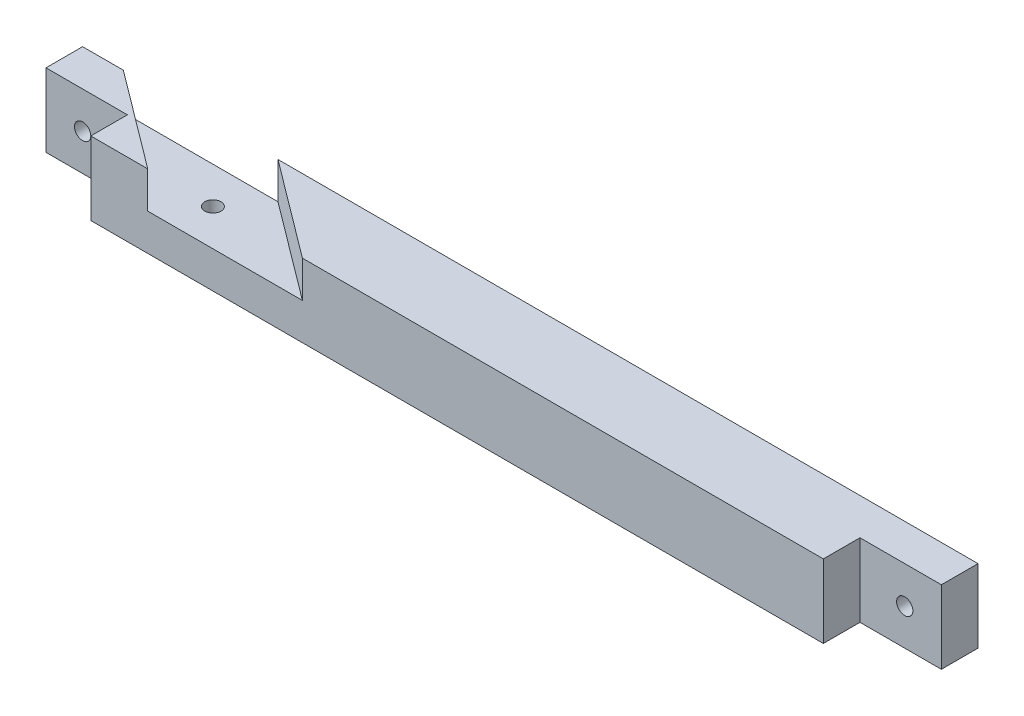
ISO-10303-21;
HEADER;
FILE_DESCRIPTION(('STEP AP214'),'2;1');
FILE_NAME('part.step','',(''),(''),'','','');
FILE_SCHEMA(('AUTOMOTIVE_DESIGN { 1 0 10303 214 1 1 1 1 }'));
ENDSEC;
DATA;
#1=APPLICATION_CONTEXT('core data for automotive mechanical design processes');
#2=APPLICATION_PROTOCOL_DEFINITION('international standard','automotive_design',2000,#1);
#3=PRODUCT_CONTEXT('',#1,'mechanical');
#4=PRODUCT('Part','Part','',(#3));
#5=PRODUCT_RELATED_PRODUCT_CATEGORY('part','',(#4));
#6=PRODUCT_DEFINITION_FORMATION('','',#4);
#7=PRODUCT_DEFINITION_CONTEXT('part definition',#1,'design');
#8=PRODUCT_DEFINITION('design','',#6,#7);
#9=PRODUCT_DEFINITION_SHAPE('','',#8);
#10=(LENGTH_UNIT() NAMED_UNIT(*) SI_UNIT(.MILLI.,.METRE.));
#11=(NAMED_UNIT(*) PLANE_ANGLE_UNIT() SI_UNIT($,.RADIAN.));
#12=(NAMED_UNIT(*) SI_UNIT($,.STERADIAN.) SOLID_ANGLE_UNIT());
#13=UNCERTAINTY_MEASURE_WITH_UNIT(LENGTH_MEASURE(1.E-05),#10,'distance_accuracy_value','');
#14=(GEOMETRIC_REPRESENTATION_CONTEXT(3) GLOBAL_UNCERTAINTY_ASSIGNED_CONTEXT((#13)) GLOBAL_UNIT_ASSIGNED_CONTEXT((#10,
#11,#12)) REPRESENTATION_CONTEXT('',''));
#15=CARTESIAN_POINT('',(0.,0.,0.));
#16=DIRECTION('',(0.,0.,1.));
#17=DIRECTION('',(1.,0.,0.));
#18=AXIS2_PLACEMENT_3D('',#15,#16,#17);
#19=CARTESIAN_POINT('',(-67.2716845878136,-100.617562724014,9.));
#20=DIRECTION('',(0.,-1.,0.));
#21=DIRECTION('',(0.,0.,-1.));
#22=AXIS2_PLACEMENT_3D('',#19,#20,#21);
#23=PLANE('',#22);
#24=DIRECTION('',(-1.,0.,0.));
#25=VECTOR('',#24,1.);
#26=CARTESIAN_POINT('',(-67.2716845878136,-100.617562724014,9.));
#27=LINE('',#26,#25);
#28=CARTESIAN_POINT('',(-50.2716845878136,-100.617562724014,9.));
#29=VERTEX_POINT('',#28);
#30=CARTESIAN_POINT('',(-57.2716845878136,-100.617562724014,9.));
#31=VERTEX_POINT('',#30);
#32=EDGE_CURVE('E210',#29,#31,#27,.T.);
#33=ORIENTED_EDGE('',*,*,#32,.F.);
#34=DIRECTION('',(0.8,0.,0.6));
#35=VECTOR('',#34,1.);
#36=CARTESIAN_POINT('',(-50.2716845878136,-100.617562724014,9.));
#37=LINE('',#36,#35);
#38=CARTESIAN_POINT('',(-62.2716845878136,-100.617562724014,0.));
#39=VERTEX_POINT('',#38);
#40=EDGE_CURVE('E138',#39,#29,#37,.T.);
#41=ORIENTED_EDGE('',*,*,#40,.F.);
#42=DIRECTION('',(-1.,0.,0.));
#43=VECTOR('',#42,1.);
#44=CARTESIAN_POINT('',(-67.2716845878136,-100.617562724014,0.));
#45=LINE('',#44,#43);
#46=CARTESIAN_POINT('',(-67.2716845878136,-100.617562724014,0.));
#47=VERTEX_POINT('',#46);
#48=EDGE_CURVE('E223',#39,#47,#45,.T.);
#49=ORIENTED_EDGE('',*,*,#48,.T.);
#50=DIRECTION('',(0.,0.,-1.));
#51=VECTOR('',#50,1.);
#52=CARTESIAN_POINT('',(-67.2716845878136,-100.617562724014,9.));
#53=LINE('',#52,#51);
#54=CARTESIAN_POINT('',(-67.2716845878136,-100.617562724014,4.5));
#55=VERTEX_POINT('',#54);
#56=EDGE_CURVE('E214',#55,#47,#53,.T.);
#57=ORIENTED_EDGE('',*,*,#56,.F.);
#58=DIRECTION('',(-1.,0.,0.));
#59=VECTOR('',#58,1.);
#60=CARTESIAN_POINT('',(-67.2716845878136,-100.617562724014,4.5));
#61=LINE('',#60,#59);
#62=CARTESIAN_POINT('',(-57.2716845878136,-100.617562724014,4.5));
#63=VERTEX_POINT('',#62);
#64=EDGE_CURVE('E197',#63,#55,#61,.T.);
#65=ORIENTED_EDGE('',*,*,#64,.F.);
#66=DIRECTION('',(0.,0.,1.));
#67=VECTOR('',#66,1.);
#68=CARTESIAN_POINT('',(-57.2716845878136,-100.617562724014,4.5));
#69=LINE('',#68,#67);
#70=EDGE_CURVE('E202',#63,#31,#69,.T.);
#71=ORIENTED_EDGE('',*,*,#70,.T.);
#72=EDGE_LOOP('',(#33,#41,#49,#57,#65,#71));
#73=FACE_BOUND('',#72,.T.);
#74=ADVANCED_FACE('F30',(#73),#23,.F.);
#75=CARTESIAN_POINT('',(42.7283154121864,-109.617562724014,9.));
#76=DIRECTION('',(-1.,0.,0.));
#77=DIRECTION('',(0.,0.,1.));
#78=AXIS2_PLACEMENT_3D('',#75,#76,#77);
#79=PLANE('',#78);
#80=DIRECTION('',(0.,1.,0.));
#81=VECTOR('',#80,1.);
#82=CARTESIAN_POINT('',(42.7283154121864,-109.617562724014,4.5));
#83=LINE('',#82,#81);
#84=CARTESIAN_POINT('',(42.7283154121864,-109.617562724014,4.5));
#85=VERTEX_POINT('',#84);
#86=CARTESIAN_POINT('',(42.7283154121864,-100.617562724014,4.5));
#87=VERTEX_POINT('',#86);
#88=EDGE_CURVE('E173',#85,#87,#83,.T.);
#89=ORIENTED_EDGE('',*,*,#88,.F.);
#90=DIRECTION('',(0.,0.,-1.));
#91=VECTOR('',#90,1.);
#92=CARTESIAN_POINT('',(42.7283154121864,-109.617562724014,9.));
#93=LINE('',#92,#91);
#94=CARTESIAN_POINT('',(42.7283154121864,-109.617562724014,0.));
#95=VERTEX_POINT('',#94);
#96=EDGE_CURVE('E230',#85,#95,#93,.T.);
#97=ORIENTED_EDGE('',*,*,#96,.T.);
#98=DIRECTION('',(0.,1.,0.));
#99=VECTOR('',#98,1.);
#100=CARTESIAN_POINT('',(42.7283154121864,-109.617562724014,0.));
#101=LINE('',#100,#99);
#102=CARTESIAN_POINT('',(42.7283154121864,-100.617562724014,0.));
#103=VERTEX_POINT('',#102);
#104=EDGE_CURVE('E220',#95,#103,#101,.T.);
#105=ORIENTED_EDGE('',*,*,#104,.T.);
#106=DIRECTION('',(0.,0.,-1.));
#107=VECTOR('',#106,1.);
#108=CARTESIAN_POINT('',(42.7283154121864,-100.617562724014,9.));
#109=LINE('',#108,#107);
#110=EDGE_CURVE('E228',#87,#103,#109,.T.);
#111=ORIENTED_EDGE('',*,*,#110,.F.);
#112=EDGE_LOOP('',(#89,#97,#105,#111));
#113=FACE_BOUND('',#112,.T.);
#114=ADVANCED_FACE('F269',(#113),#79,.F.);
#115=CARTESIAN_POINT('',(-67.2716845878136,-109.617562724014,9.));
#116=DIRECTION('',(1.,0.,0.));
#117=DIRECTION('',(0.,0.,-1.));
#118=AXIS2_PLACEMENT_3D('',#115,#116,#117);
#119=PLANE('',#118);
#120=DIRECTION('',(0.,0.,-1.));
#121=VECTOR('',#120,1.);
#122=CARTESIAN_POINT('',(-67.2716845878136,-109.617562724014,9.));
#123=LINE('',#122,#121);
#124=CARTESIAN_POINT('',(-67.2716845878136,-109.617562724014,4.5));
#125=VERTEX_POINT('',#124);
#126=CARTESIAN_POINT('',(-67.2716845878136,-109.617562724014,0.));
#127=VERTEX_POINT('',#126);
#128=EDGE_CURVE('E232',#125,#127,#123,.T.);
#129=ORIENTED_EDGE('',*,*,#128,.F.);
#130=DIRECTION('',(0.,-1.,0.));
#131=VECTOR('',#130,1.);
#132=CARTESIAN_POINT('',(-67.2716845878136,-109.617562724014,4.5));
#133=LINE('',#132,#131);
#134=EDGE_CURVE('E189',#55,#125,#133,.T.);
#135=ORIENTED_EDGE('',*,*,#134,.F.);
#136=ORIENTED_EDGE('',*,*,#56,.T.);
#137=DIRECTION('',(0.,-1.,0.));
#138=VECTOR('',#137,1.);
#139=CARTESIAN_POINT('',(-67.2716845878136,-109.617562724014,0.));
#140=LINE('',#139,#138);
#141=EDGE_CURVE('E205',#47,#127,#140,.T.);
#142=ORIENTED_EDGE('',*,*,#141,.T.);
#143=EDGE_LOOP('',(#129,#135,#136,#142));
#144=FACE_BOUND('',#143,.T.);
#145=ADVANCED_FACE('F32',(#144),#119,.F.);
#146=CARTESIAN_POINT('',(-67.2716845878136,-109.617562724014,9.));
#147=DIRECTION('',(0.,1.,0.));
#148=DIRECTION('',(0.,0.,1.));
#149=AXIS2_PLACEMENT_3D('',#146,#147,#148);
#150=PLANE('',#149);
#151=CARTESIAN_POINT('',(-46.7716845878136,-109.617562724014,4.5));
#152=DIRECTION('',(0.,1.,0.));
#153=DIRECTION('',(0.,0.,1.));
#154=AXIS2_PLACEMENT_3D('',#151,#152,#153);
#155=CIRCLE('',#154,0.999999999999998);
#156=CARTESIAN_POINT('',(-46.7716845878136,-109.617562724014,5.5));
#157=VERTEX_POINT('',#156);
#158=EDGE_CURVE('E152',#157,#157,#155,.T.);
#159=ORIENTED_EDGE('',*,*,#158,.T.);
#160=EDGE_LOOP('',(#159));
#161=FACE_BOUND('',#160,.T.);
#162=DIRECTION('',(1.,0.,0.));
#163=VECTOR('',#162,1.);
#164=CARTESIAN_POINT('',(42.7283154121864,-109.617562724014,4.5));
#165=LINE('',#164,#163);
#166=CARTESIAN_POINT('',(32.7283154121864,-109.617562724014,4.5));
#167=VERTEX_POINT('',#166);
#168=EDGE_CURVE('E181',#167,#85,#165,.T.);
#169=ORIENTED_EDGE('',*,*,#168,.F.);
#170=DIRECTION('',(0.,0.,1.));
#171=VECTOR('',#170,1.);
#172=CARTESIAN_POINT('',(32.7283154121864,-109.617562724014,4.5));
#173=LINE('',#172,#171);
#174=CARTESIAN_POINT('',(32.7283154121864,-109.617562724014,9.));
#175=VERTEX_POINT('',#174);
#176=EDGE_CURVE('E184',#167,#175,#173,.T.);
#177=ORIENTED_EDGE('',*,*,#176,.T.);
#178=DIRECTION('',(1.,0.,0.));
#179=VECTOR('',#178,1.);
#180=CARTESIAN_POINT('',(-67.2716845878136,-109.617562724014,9.));
#181=LINE('',#180,#179);
#182=CARTESIAN_POINT('',(-57.2716845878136,-109.617562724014,9.));
#183=VERTEX_POINT('',#182);
#184=EDGE_CURVE('E207',#183,#175,#181,.T.);
#185=ORIENTED_EDGE('',*,*,#184,.F.);
#186=DIRECTION('',(0.,0.,1.));
#187=VECTOR('',#186,1.);
#188=CARTESIAN_POINT('',(-57.2716845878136,-109.617562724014,4.5));
#189=LINE('',#188,#187);
#190=CARTESIAN_POINT('',(-57.2716845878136,-109.617562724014,4.5));
#191=VERTEX_POINT('',#190);
#192=EDGE_CURVE('E199',#191,#183,#189,.T.);
#193=ORIENTED_EDGE('',*,*,#192,.F.);
#194=DIRECTION('',(1.,0.,0.));
#195=VECTOR('',#194,1.);
#196=CARTESIAN_POINT('',(-67.2716845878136,-109.617562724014,4.5));
#197=LINE('',#196,#195);
#198=EDGE_CURVE('E191',#125,#191,#197,.T.);
#199=ORIENTED_EDGE('',*,*,#198,.F.);
#200=ORIENTED_EDGE('',*,*,#128,.T.);
#201=DIRECTION('',(1.,0.,0.));
#202=VECTOR('',#201,1.);
#203=CARTESIAN_POINT('',(-67.2716845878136,-109.617562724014,0.));
#204=LINE('',#203,#202);
#205=EDGE_CURVE('E217',#127,#95,#204,.T.);
#206=ORIENTED_EDGE('',*,*,#205,.T.);
#207=ORIENTED_EDGE('',*,*,#96,.F.);
#208=EDGE_LOOP('',(#169,#177,#185,#193,#199,#200,#206,#207));
#209=FACE_BOUND('',#208,.T.);
#210=ADVANCED_FACE('F254',(#161,#209),#150,.F.);
#211=CARTESIAN_POINT('',(-43.2716845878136,-100.617562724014,0.));
#212=VERTEX_POINT('',#211);
#213=EDGE_CURVE('E211',#103,#212,#45,.T.);
#214=ORIENTED_EDGE('',*,*,#213,.T.);
#215=DIRECTION('',(-0.8,0.,-0.6));
#216=VECTOR('',#215,1.);
#217=CARTESIAN_POINT('',(-43.2716845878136,-100.617562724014,0.));
#218=LINE('',#217,#216);
#219=CARTESIAN_POINT('',(-31.2716845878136,-100.617562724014,9.));
#220=VERTEX_POINT('',#219);
#221=EDGE_CURVE('E132',#220,#212,#218,.T.);
#222=ORIENTED_EDGE('',*,*,#221,.F.);
#223=CARTESIAN_POINT('',(32.7283154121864,-100.617562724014,9.));
#224=VERTEX_POINT('',#223);
#225=EDGE_CURVE('E212',#224,#220,#27,.T.);
#226=ORIENTED_EDGE('',*,*,#225,.F.);
#227=DIRECTION('',(0.,0.,1.));
#228=VECTOR('',#227,1.);
#229=CARTESIAN_POINT('',(32.7283154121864,-100.617562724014,4.5));
#230=LINE('',#229,#228);
#231=CARTESIAN_POINT('',(32.7283154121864,-100.617562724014,4.5));
#232=VERTEX_POINT('',#231);
#233=EDGE_CURVE('E53',#232,#224,#230,.T.);
#234=ORIENTED_EDGE('',*,*,#233,.F.);
#235=DIRECTION('',(-1.,0.,0.));
#236=VECTOR('',#235,1.);
#237=CARTESIAN_POINT('',(42.7283154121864,-100.617562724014,4.5));
#238=LINE('',#237,#236);
#239=EDGE_CURVE('E175',#87,#232,#238,.T.);
#240=ORIENTED_EDGE('',*,*,#239,.F.);
#241=ORIENTED_EDGE('',*,*,#110,.T.);
#242=EDGE_LOOP('',(#214,#222,#226,#234,#240,#241));
#243=FACE_BOUND('',#242,.T.);
#244=ADVANCED_FACE('F259',(#243),#23,.F.);
#245=CARTESIAN_POINT('',(-67.2716845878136,-100.617562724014,9.));
#246=DIRECTION('',(0.,0.,-1.));
#247=DIRECTION('',(-1.,0.,0.));
#248=AXIS2_PLACEMENT_3D('',#245,#246,#247);
#249=PLANE('',#248);
#250=DIRECTION('',(1.,0.,0.));
#251=VECTOR('',#250,1.);
#252=CARTESIAN_POINT('',(-31.2716845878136,-105.117562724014,9.));
#253=LINE('',#252,#251);
#254=CARTESIAN_POINT('',(-50.2716845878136,-105.117562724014,9.));
#255=VERTEX_POINT('',#254);
#256=CARTESIAN_POINT('',(-31.2716845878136,-105.117562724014,9.));
#257=VERTEX_POINT('',#256);
#258=EDGE_CURVE('E129',#255,#257,#253,.T.);
#259=ORIENTED_EDGE('',*,*,#258,.F.);
#260=DIRECTION('',(0.,1.,0.));
#261=VECTOR('',#260,1.);
#262=CARTESIAN_POINT('',(-50.2716845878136,-105.117562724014,9.));
#263=LINE('',#262,#261);
#264=EDGE_CURVE('E135',#255,#29,#263,.T.);
#265=ORIENTED_EDGE('',*,*,#264,.T.);
#266=ORIENTED_EDGE('',*,*,#32,.T.);
#267=DIRECTION('',(0.,1.,0.));
#268=VECTOR('',#267,1.);
#269=CARTESIAN_POINT('',(-57.2716845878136,-109.617562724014,9.));
#270=LINE('',#269,#268);
#271=EDGE_CURVE('E187',#183,#31,#270,.T.);
#272=ORIENTED_EDGE('',*,*,#271,.F.);
#273=ORIENTED_EDGE('',*,*,#184,.T.);
#274=DIRECTION('',(0.,-1.,0.));
#275=VECTOR('',#274,1.);
#276=CARTESIAN_POINT('',(32.7283154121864,-109.617562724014,9.));
#277=LINE('',#276,#275);
#278=EDGE_CURVE('E170',#224,#175,#277,.T.);
#279=ORIENTED_EDGE('',*,*,#278,.F.);
#280=ORIENTED_EDGE('',*,*,#225,.T.);
#281=DIRECTION('',(0.,1.,0.));
#282=VECTOR('',#281,1.);
#283=CARTESIAN_POINT('',(-31.2716845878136,-105.117562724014,9.));
#284=LINE('',#283,#282);
#285=EDGE_CURVE('E141',#257,#220,#284,.T.);
#286=ORIENTED_EDGE('',*,*,#285,.F.);
#287=EDGE_LOOP('',(#259,#265,#266,#272,#273,#279,#280,#286));
#288=FACE_BOUND('',#287,.T.);
#289=ADVANCED_FACE('F143',(#288),#249,.F.);
#290=CARTESIAN_POINT('',(-67.2716845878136,-100.617562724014,0.));
#291=DIRECTION('',(0.,0.,-1.));
#292=DIRECTION('',(-1.,0.,0.));
#293=AXIS2_PLACEMENT_3D('',#290,#291,#292);
#294=PLANE('',#293);
#295=DIRECTION('',(0.,1.,0.));
#296=VECTOR('',#295,1.);
#297=CARTESIAN_POINT('',(-62.2716845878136,-105.117562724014,0.));
#298=LINE('',#297,#296);
#299=CARTESIAN_POINT('',(-62.2716845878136,-104.25153732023,0.));
#300=VERTEX_POINT('',#299);
#301=EDGE_CURVE('E154',#300,#39,#298,.T.);
#302=ORIENTED_EDGE('',*,*,#301,.F.);
#303=CARTESIAN_POINT('',(-62.7716845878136,-105.117562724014,0.));
#304=DIRECTION('',(0.,0.,1.));
#305=DIRECTION('',(1.,0.,0.));
#306=AXIS2_PLACEMENT_3D('',#303,#304,#305);
#307=CIRCLE('',#306,0.999999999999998);
#308=CARTESIAN_POINT('',(-61.7716845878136,-105.117562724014,0.));
#309=VERTEX_POINT('',#308);
#310=EDGE_CURVE('E161',#300,#309,#307,.T.);
#311=ORIENTED_EDGE('',*,*,#310,.T.);
#312=DIRECTION('',(-1.,0.,0.));
#313=VECTOR('',#312,1.);
#314=CARTESIAN_POINT('',(-62.2716845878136,-105.117562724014,0.));
#315=LINE('',#314,#313);
#316=CARTESIAN_POINT('',(-43.2716845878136,-105.117562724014,0.));
#317=VERTEX_POINT('',#316);
#318=EDGE_CURVE('E45',#317,#309,#315,.T.);
#319=ORIENTED_EDGE('',*,*,#318,.F.);
#320=DIRECTION('',(0.,1.,0.));
#321=VECTOR('',#320,1.);
#322=CARTESIAN_POINT('',(-43.2716845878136,-105.117562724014,0.));
#323=LINE('',#322,#321);
#324=EDGE_CURVE('E157',#317,#212,#323,.T.);
#325=ORIENTED_EDGE('',*,*,#324,.T.);
#326=ORIENTED_EDGE('',*,*,#213,.F.);
#327=ORIENTED_EDGE('',*,*,#104,.F.);
#328=ORIENTED_EDGE('',*,*,#205,.F.);
#329=ORIENTED_EDGE('',*,*,#141,.F.);
#330=ORIENTED_EDGE('',*,*,#48,.F.);
#331=EDGE_LOOP('',(#302,#311,#319,#325,#326,#327,#328,#329,#330));
#332=FACE_BOUND('',#331,.T.);
#333=CARTESIAN_POINT('',(38.2284017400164,-105.145436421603,0.));
#334=DIRECTION('',(0.,0.,1.));
#335=DIRECTION('',(1.,0.,0.));
#336=AXIS2_PLACEMENT_3D('',#333,#334,#335);
#337=CIRCLE('',#336,0.999999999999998);
#338=CARTESIAN_POINT('',(39.2284017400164,-105.145436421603,0.));
#339=VERTEX_POINT('',#338);
#340=EDGE_CURVE('E167',#339,#339,#337,.T.);
#341=ORIENTED_EDGE('',*,*,#340,.T.);
#342=EDGE_LOOP('',(#341));
#343=FACE_BOUND('',#342,.T.);
#344=ADVANCED_FACE('F239',(#332,#343),#294,.T.);
#345=CARTESIAN_POINT('',(-57.2716845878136,-109.617562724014,4.5));
#346=DIRECTION('',(1.,0.,0.));
#347=DIRECTION('',(0.,1.,0.));
#348=AXIS2_PLACEMENT_3D('',#345,#346,#347);
#349=PLANE('',#348);
#350=ORIENTED_EDGE('',*,*,#271,.T.);
#351=ORIENTED_EDGE('',*,*,#70,.F.);
#352=DIRECTION('',(0.,1.,0.));
#353=VECTOR('',#352,1.);
#354=CARTESIAN_POINT('',(-57.2716845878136,-109.617562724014,4.5));
#355=LINE('',#354,#353);
#356=EDGE_CURVE('E194',#191,#63,#355,.T.);
#357=ORIENTED_EDGE('',*,*,#356,.F.);
#358=ORIENTED_EDGE('',*,*,#192,.T.);
#359=EDGE_LOOP('',(#350,#351,#357,#358));
#360=FACE_BOUND('',#359,.T.);
#361=ADVANCED_FACE('F249',(#360),#349,.F.);
#362=CARTESIAN_POINT('',(-67.2716845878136,-100.617562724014,4.5));
#363=DIRECTION('',(0.,0.,-1.));
#364=DIRECTION('',(-1.,0.,0.));
#365=AXIS2_PLACEMENT_3D('',#362,#363,#364);
#366=PLANE('',#365);
#367=CARTESIAN_POINT('',(-62.7716845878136,-105.117562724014,4.5));
#368=DIRECTION('',(0.,0.,1.));
#369=DIRECTION('',(1.,0.,0.));
#370=AXIS2_PLACEMENT_3D('',#367,#368,#369);
#371=CIRCLE('',#370,0.999999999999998);
#372=CARTESIAN_POINT('',(-61.7716845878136,-105.117562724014,4.5));
#373=VERTEX_POINT('',#372);
#374=EDGE_CURVE('E156',#373,#373,#371,.T.);
#375=ORIENTED_EDGE('',*,*,#374,.F.);
#376=EDGE_LOOP('',(#375));
#377=FACE_BOUND('',#376,.T.);
#378=ORIENTED_EDGE('',*,*,#134,.T.);
#379=ORIENTED_EDGE('',*,*,#198,.T.);
#380=ORIENTED_EDGE('',*,*,#356,.T.);
#381=ORIENTED_EDGE('',*,*,#64,.T.);
#382=EDGE_LOOP('',(#378,#379,#380,#381));
#383=FACE_BOUND('',#382,.T.);
#384=ADVANCED_FACE('F274',(#377,#383),#366,.F.);
#385=CARTESIAN_POINT('',(32.7283154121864,-109.617562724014,4.5));
#386=DIRECTION('',(-1.,0.,0.));
#387=DIRECTION('',(0.,0.,1.));
#388=AXIS2_PLACEMENT_3D('',#385,#386,#387);
#389=PLANE('',#388);
#390=ORIENTED_EDGE('',*,*,#278,.T.);
#391=ORIENTED_EDGE('',*,*,#176,.F.);
#392=DIRECTION('',(0.,-1.,0.));
#393=VECTOR('',#392,1.);
#394=CARTESIAN_POINT('',(32.7283154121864,-109.617562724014,4.5));
#395=LINE('',#394,#393);
#396=EDGE_CURVE('E178',#232,#167,#395,.T.);
#397=ORIENTED_EDGE('',*,*,#396,.F.);
#398=ORIENTED_EDGE('',*,*,#233,.T.);
#399=EDGE_LOOP('',(#390,#391,#397,#398));
#400=FACE_BOUND('',#399,.T.);
#401=ADVANCED_FACE('F276',(#400),#389,.F.);
#402=CARTESIAN_POINT('',(42.7283154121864,-100.617562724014,4.5));
#403=DIRECTION('',(0.,0.,1.));
#404=DIRECTION('',(1.,0.,0.));
#405=AXIS2_PLACEMENT_3D('',#402,#403,#404);
#406=PLANE('',#405);
#407=CARTESIAN_POINT('',(38.2284017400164,-105.145436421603,4.5));
#408=DIRECTION('',(0.,0.,1.));
#409=DIRECTION('',(1.,0.,0.));
#410=AXIS2_PLACEMENT_3D('',#407,#408,#409);
#411=CIRCLE('',#410,0.999999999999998);
#412=CARTESIAN_POINT('',(39.2284017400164,-105.145436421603,4.5));
#413=VERTEX_POINT('',#412);
#414=EDGE_CURVE('E164',#413,#413,#411,.T.);
#415=ORIENTED_EDGE('',*,*,#414,.F.);
#416=EDGE_LOOP('',(#415));
#417=FACE_BOUND('',#416,.T.);
#418=ORIENTED_EDGE('',*,*,#88,.T.);
#419=ORIENTED_EDGE('',*,*,#239,.T.);
#420=ORIENTED_EDGE('',*,*,#396,.T.);
#421=ORIENTED_EDGE('',*,*,#168,.T.);
#422=EDGE_LOOP('',(#418,#419,#420,#421));
#423=FACE_BOUND('',#422,.T.);
#424=ADVANCED_FACE('F283',(#417,#423),#406,.T.);
#425=CARTESIAN_POINT('',(38.2284017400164,-105.145436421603,0.));
#426=DIRECTION('',(0.,0.,1.));
#427=DIRECTION('',(1.,0.,0.));
#428=AXIS2_PLACEMENT_3D('',#425,#426,#427);
#429=CYLINDRICAL_SURFACE('',#428,0.999999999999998);
#430=ORIENTED_EDGE('',*,*,#340,.F.);
#431=EDGE_LOOP('',(#430));
#432=FACE_BOUND('',#431,.T.);
#433=ORIENTED_EDGE('',*,*,#414,.T.);
#434=EDGE_LOOP('',(#433));
#435=FACE_BOUND('',#434,.T.);
#436=ADVANCED_FACE('F326',(#432,#435),#429,.F.);
#437=CARTESIAN_POINT('',(-62.7716845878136,-105.117562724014,0.));
#438=DIRECTION('',(0.,0.,1.));
#439=DIRECTION('',(1.,0.,0.));
#440=AXIS2_PLACEMENT_3D('',#437,#438,#439);
#441=CYLINDRICAL_SURFACE('',#440,0.999999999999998);
#442=ORIENTED_EDGE('',*,*,#310,.F.);
#443=CARTESIAN_POINT('',(-62.7716845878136,-105.117562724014,-0.374999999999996));
#444=DIRECTION('',(-0.6,0.,0.8));
#445=DIRECTION('',(0.8,0.,0.6));
#446=AXIS2_PLACEMENT_3D('',#443,#444,#445);
#447=ELLIPSE('',#446,1.25,0.999999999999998);
#448=CARTESIAN_POINT('',(-61.7716845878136,-105.117562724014,0.375000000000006));
#449=VERTEX_POINT('',#448);
#450=EDGE_CURVE('E11',#300,#449,#447,.F.);
#451=ORIENTED_EDGE('',*,*,#450,.T.);
#452=DIRECTION('',(0.,0.,1.));
#453=VECTOR('',#452,1.);
#454=CARTESIAN_POINT('',(-61.7716845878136,-105.117562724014,0.));
#455=LINE('',#454,#453);
#456=EDGE_CURVE('E38',#449,#309,#455,.F.);
#457=ORIENTED_EDGE('',*,*,#456,.T.);
#458=EDGE_LOOP('',(#442,#451,#457));
#459=FACE_BOUND('',#458,.T.);
#460=ORIENTED_EDGE('',*,*,#374,.T.);
#461=EDGE_LOOP('',(#460));
#462=FACE_BOUND('',#461,.T.);
#463=ADVANCED_FACE('F235',(#459,#462),#441,.F.);
#464=CARTESIAN_POINT('',(-50.2716845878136,-105.117562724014,9.));
#465=DIRECTION('',(-0.6,0.,0.8));
#466=DIRECTION('',(0.8,0.,0.6));
#467=AXIS2_PLACEMENT_3D('',#464,#465,#466);
#468=PLANE('',#467);
#469=ORIENTED_EDGE('',*,*,#301,.T.);
#470=ORIENTED_EDGE('',*,*,#40,.T.);
#471=ORIENTED_EDGE('',*,*,#264,.F.);
#472=DIRECTION('',(0.8,0.,0.6));
#473=VECTOR('',#472,1.);
#474=CARTESIAN_POINT('',(-50.2716845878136,-105.117562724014,9.));
#475=LINE('',#474,#473);
#476=EDGE_CURVE('E125',#449,#255,#475,.T.);
#477=ORIENTED_EDGE('',*,*,#476,.F.);
#478=ORIENTED_EDGE('',*,*,#450,.F.);
#479=EDGE_LOOP('',(#469,#470,#471,#477,#478));
#480=FACE_BOUND('',#479,.T.);
#481=ADVANCED_FACE('F136',(#480),#468,.F.);
#482=CARTESIAN_POINT('',(-62.2716845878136,-105.117562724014,0.));
#483=DIRECTION('',(0.,-1.,0.));
#484=DIRECTION('',(0.,0.,-1.));
#485=AXIS2_PLACEMENT_3D('',#482,#483,#484);
#486=PLANE('',#485);
#487=CARTESIAN_POINT('',(-46.7716845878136,-105.117562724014,4.5));
#488=DIRECTION('',(0.,1.,0.));
#489=DIRECTION('',(0.,0.,1.));
#490=AXIS2_PLACEMENT_3D('',#487,#488,#489);
#491=CIRCLE('',#490,0.999999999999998);
#492=CARTESIAN_POINT('',(-46.7716845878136,-105.117562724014,5.5));
#493=VERTEX_POINT('',#492);
#494=EDGE_CURVE('E307',#493,#493,#491,.T.);
#495=ORIENTED_EDGE('',*,*,#494,.F.);
#496=EDGE_LOOP('',(#495));
#497=FACE_BOUND('',#496,.T.);
#498=ORIENTED_EDGE('',*,*,#476,.T.);
#499=ORIENTED_EDGE('',*,*,#258,.T.);
#500=DIRECTION('',(-0.8,0.,-0.6));
#501=VECTOR('',#500,1.);
#502=CARTESIAN_POINT('',(-43.2716845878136,-105.117562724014,0.));
#503=LINE('',#502,#501);
#504=EDGE_CURVE('E145',#257,#317,#503,.T.);
#505=ORIENTED_EDGE('',*,*,#504,.T.);
#506=ORIENTED_EDGE('',*,*,#318,.T.);
#507=ORIENTED_EDGE('',*,*,#456,.F.);
#508=EDGE_LOOP('',(#498,#499,#505,#506,#507));
#509=FACE_BOUND('',#508,.T.);
#510=ADVANCED_FACE('F127',(#497,#509),#486,.F.);
#511=CARTESIAN_POINT('',(-43.2716845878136,-105.117562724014,0.));
#512=DIRECTION('',(0.6,0.,-0.8));
#513=DIRECTION('',(-0.8,0.,-0.6));
#514=AXIS2_PLACEMENT_3D('',#511,#512,#513);
#515=PLANE('',#514);
#516=ORIENTED_EDGE('',*,*,#221,.T.);
#517=ORIENTED_EDGE('',*,*,#324,.F.);
#518=ORIENTED_EDGE('',*,*,#504,.F.);
#519=ORIENTED_EDGE('',*,*,#285,.T.);
#520=EDGE_LOOP('',(#516,#517,#518,#519));
#521=FACE_BOUND('',#520,.T.);
#522=ADVANCED_FACE('F263',(#521),#515,.F.);
#523=CARTESIAN_POINT('',(-46.7716845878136,-109.617562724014,4.5));
#524=DIRECTION('',(0.,1.,0.));
#525=DIRECTION('',(0.,0.,1.));
#526=AXIS2_PLACEMENT_3D('',#523,#524,#525);
#527=CYLINDRICAL_SURFACE('',#526,0.999999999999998);
#528=ORIENTED_EDGE('',*,*,#158,.F.);
#529=EDGE_LOOP('',(#528));
#530=FACE_BOUND('',#529,.T.);
#531=ORIENTED_EDGE('',*,*,#494,.T.);
#532=EDGE_LOOP('',(#531));
#533=FACE_BOUND('',#532,.T.);
#534=ADVANCED_FACE('F312',(#530,#533),#527,.F.);
#535=CLOSED_SHELL('',(#74,#114,#145,#210,#244,#289,#344,#361,#384,#401,#424,#436,#463,#481,#510,
#522,#534));
#536=MANIFOLD_SOLID_BREP('B2',#535);
#537=ADVANCED_BREP_SHAPE_REPRESENTATION('',(#18,#536),#14);
#538=SHAPE_DEFINITION_REPRESENTATION(#9,#537);
ENDSEC;
END-ISO-10303-21;
